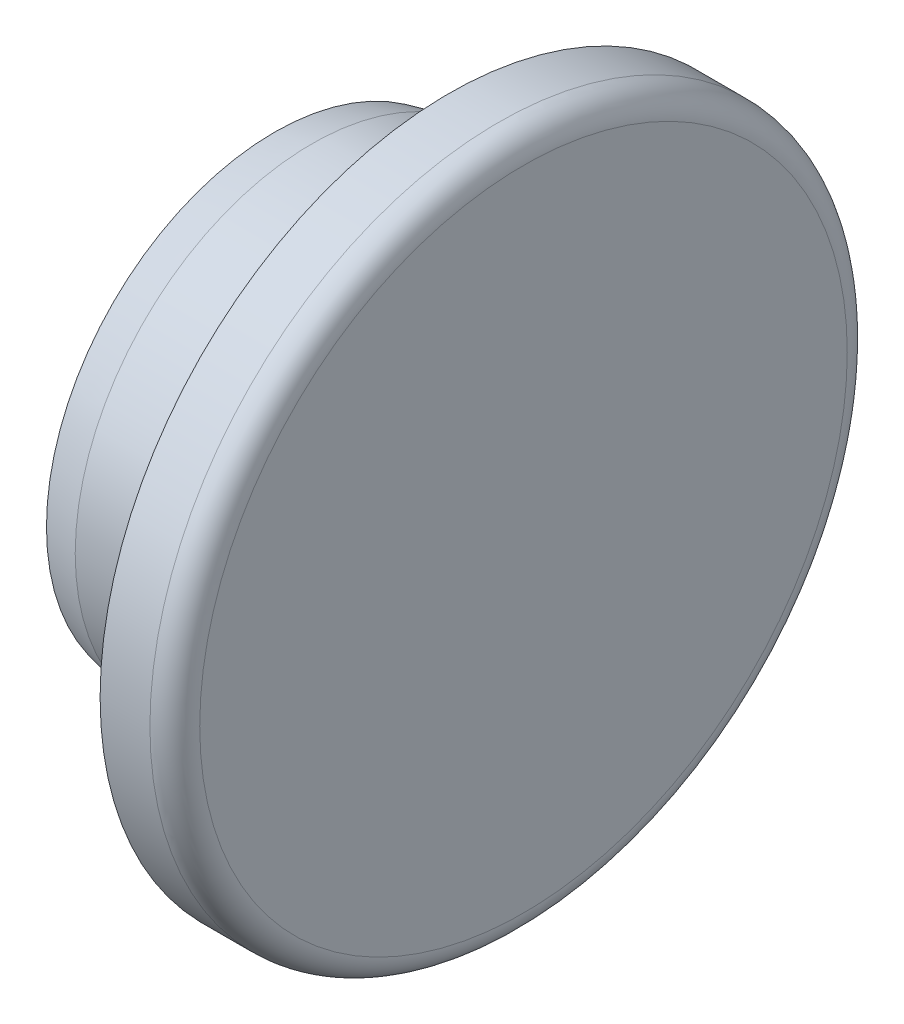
from build123d import *

# Parameters (mm, degrees)
CONG_1_R         = 1
CHANFREIN1_SIZE  = 1.5
CHANFREIN1_SIZE2 = 0.346302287


with BuildPart() as part:
    # Esquisse1 → R_volution1 (revolve)
    with BuildSketch(Plane.XY, mode=Mode.PRIVATE) as r_volution1_sk:
        Polygon((0, 9.5), (7, 9.5), (7, 14), (10, 14), (10, 0), (7, 0), (7, 7), (0, 7), align=None)
    revolve(r_volution1_sk.sketch.rotate(Axis((-7.215433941, 0, 0), (1, 0, 0)), 90), axis=Axis((-7.215433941, 0, 0), (1, 0, 0)))

    # Cong_1
    cong_1_edges = [part.edges().sort_by_distance(p)[0] for p in [
        (10, 0, -14),
    ]]
    fillet(cong_1_edges, radius=CONG_1_R)

    # Chanfrein1
    chanfrein1_edges = [part.edges().sort_by_distance(p)[0] for p in [
        (0, 0, -9.5),
    ]]
    chanfrein1_side = [part.faces().sort_by_distance(p)[0] for p in [
        (3.5, 0, -9.5),
    ]]
    chamfer(chanfrein1_edges, length=CHANFREIN1_SIZE, length2=CHANFREIN1_SIZE2, reference=chanfrein1_side[0])


solid = part.part
